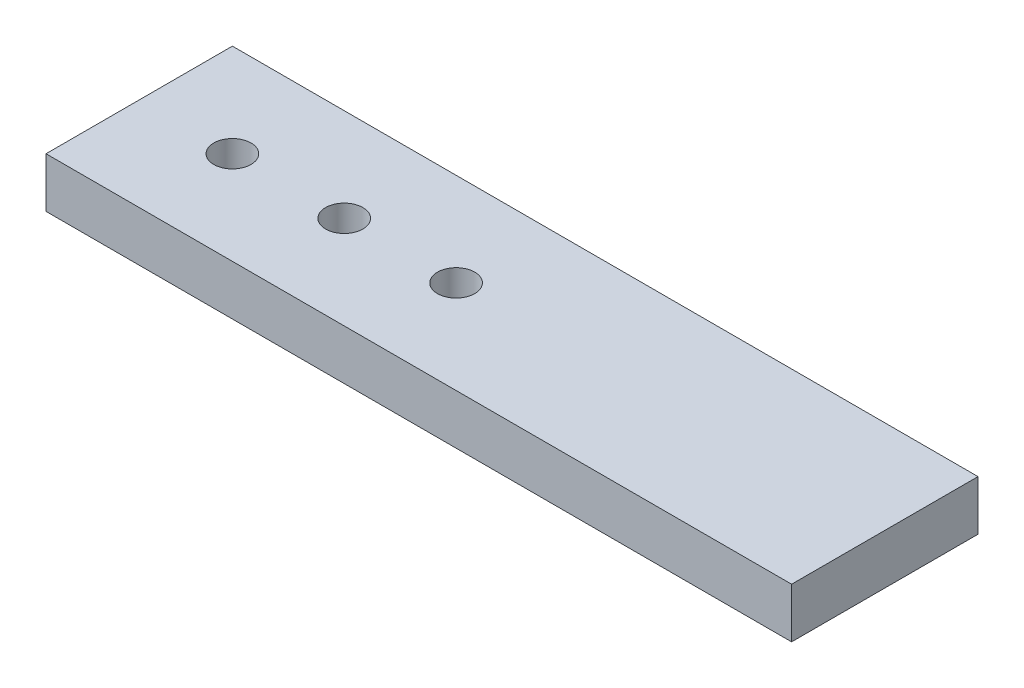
ISO-10303-21;
HEADER;
FILE_DESCRIPTION(('STEP AP214'),'2;1');
FILE_NAME('part.step','',(''),(''),'','','');
FILE_SCHEMA(('AUTOMOTIVE_DESIGN { 1 0 10303 214 1 1 1 1 }'));
ENDSEC;
DATA;
#1=APPLICATION_CONTEXT('core data for automotive mechanical design processes');
#2=APPLICATION_PROTOCOL_DEFINITION('international standard','automotive_design',2000,#1);
#3=PRODUCT_CONTEXT('',#1,'mechanical');
#4=PRODUCT('Part','Part','',(#3));
#5=PRODUCT_RELATED_PRODUCT_CATEGORY('part','',(#4));
#6=PRODUCT_DEFINITION_FORMATION('','',#4);
#7=PRODUCT_DEFINITION_CONTEXT('part definition',#1,'design');
#8=PRODUCT_DEFINITION('design','',#6,#7);
#9=PRODUCT_DEFINITION_SHAPE('','',#8);
#10=(LENGTH_UNIT() NAMED_UNIT(*) SI_UNIT(.MILLI.,.METRE.));
#11=(NAMED_UNIT(*) PLANE_ANGLE_UNIT() SI_UNIT($,.RADIAN.));
#12=(NAMED_UNIT(*) SI_UNIT($,.STERADIAN.) SOLID_ANGLE_UNIT());
#13=UNCERTAINTY_MEASURE_WITH_UNIT(LENGTH_MEASURE(1.E-05),#10,'distance_accuracy_value','');
#14=(GEOMETRIC_REPRESENTATION_CONTEXT(3) GLOBAL_UNCERTAINTY_ASSIGNED_CONTEXT((#13)) GLOBAL_UNIT_ASSIGNED_CONTEXT((#10,
#11,#12)) REPRESENTATION_CONTEXT('',''));
#15=CARTESIAN_POINT('',(0.,0.,0.));
#16=DIRECTION('',(0.,0.,1.));
#17=DIRECTION('',(1.,0.,0.));
#18=AXIS2_PLACEMENT_3D('',#15,#16,#17);
#19=CARTESIAN_POINT('',(0.,13.4,0.));
#20=DIRECTION('',(1.,0.,0.));
#21=DIRECTION('',(0.,0.,-1.));
#22=AXIS2_PLACEMENT_3D('',#19,#20,#21);
#23=PLANE('',#22);
#24=DIRECTION('',(0.,0.,1.));
#25=VECTOR('',#24,1.);
#26=CARTESIAN_POINT('',(0.,0.,0.));
#27=LINE('',#26,#25);
#28=CARTESIAN_POINT('',(0.,0.,-50.));
#29=VERTEX_POINT('',#28);
#30=CARTESIAN_POINT('',(0.,0.,0.));
#31=VERTEX_POINT('',#30);
#32=EDGE_CURVE('E102',#29,#31,#27,.T.);
#33=ORIENTED_EDGE('',*,*,#32,.T.);
#34=DIRECTION('',(0.,-1.,0.));
#35=VECTOR('',#34,1.);
#36=CARTESIAN_POINT('',(0.,13.4,0.));
#37=LINE('',#36,#35);
#38=CARTESIAN_POINT('',(0.,13.4,0.));
#39=VERTEX_POINT('',#38);
#40=EDGE_CURVE('E93',#39,#31,#37,.T.);
#41=ORIENTED_EDGE('',*,*,#40,.F.);
#42=DIRECTION('',(0.,0.,1.));
#43=VECTOR('',#42,1.);
#44=CARTESIAN_POINT('',(0.,13.4,0.));
#45=LINE('',#44,#43);
#46=CARTESIAN_POINT('',(0.,13.4,-50.));
#47=VERTEX_POINT('',#46);
#48=EDGE_CURVE('E87',#47,#39,#45,.T.);
#49=ORIENTED_EDGE('',*,*,#48,.F.);
#50=DIRECTION('',(0.,-1.,0.));
#51=VECTOR('',#50,1.);
#52=CARTESIAN_POINT('',(0.,13.4,-50.));
#53=LINE('',#52,#51);
#54=EDGE_CURVE('E98',#47,#29,#53,.T.);
#55=ORIENTED_EDGE('',*,*,#54,.T.);
#56=EDGE_LOOP('',(#33,#41,#49,#55));
#57=FACE_BOUND('',#56,.T.);
#58=ADVANCED_FACE('F33',(#57),#23,.F.);
#59=CARTESIAN_POINT('',(0.,13.4,0.));
#60=DIRECTION('',(0.,0.,-1.));
#61=DIRECTION('',(-1.,0.,0.));
#62=AXIS2_PLACEMENT_3D('',#59,#60,#61);
#63=PLANE('',#62);
#64=DIRECTION('',(1.,0.,0.));
#65=VECTOR('',#64,1.);
#66=CARTESIAN_POINT('',(0.,0.,0.));
#67=LINE('',#66,#65);
#68=CARTESIAN_POINT('',(199.999999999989,0.,0.));
#69=VERTEX_POINT('',#68);
#70=EDGE_CURVE('E92',#31,#69,#67,.T.);
#71=ORIENTED_EDGE('',*,*,#70,.T.);
#72=DIRECTION('',(0.,-1.,0.));
#73=VECTOR('',#72,1.);
#74=CARTESIAN_POINT('',(199.999999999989,13.4,0.));
#75=LINE('',#74,#73);
#76=CARTESIAN_POINT('',(199.999999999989,13.4,0.));
#77=VERTEX_POINT('',#76);
#78=EDGE_CURVE('E90',#77,#69,#75,.T.);
#79=ORIENTED_EDGE('',*,*,#78,.F.);
#80=DIRECTION('',(1.,0.,0.));
#81=VECTOR('',#80,1.);
#82=CARTESIAN_POINT('',(0.,13.4,0.));
#83=LINE('',#82,#81);
#84=EDGE_CURVE('E81',#39,#77,#83,.T.);
#85=ORIENTED_EDGE('',*,*,#84,.F.);
#86=ORIENTED_EDGE('',*,*,#40,.T.);
#87=EDGE_LOOP('',(#71,#79,#85,#86));
#88=FACE_BOUND('',#87,.T.);
#89=ADVANCED_FACE('F91',(#88),#63,.F.);
#90=CARTESIAN_POINT('',(199.999999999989,13.4,0.));
#91=DIRECTION('',(-1.,0.,0.));
#92=DIRECTION('',(0.,0.,1.));
#93=AXIS2_PLACEMENT_3D('',#90,#91,#92);
#94=PLANE('',#93);
#95=DIRECTION('',(0.,0.,-1.));
#96=VECTOR('',#95,1.);
#97=CARTESIAN_POINT('',(199.999999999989,0.,0.));
#98=LINE('',#97,#96);
#99=CARTESIAN_POINT('',(199.999999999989,0.,-50.));
#100=VERTEX_POINT('',#99);
#101=EDGE_CURVE('E67',#69,#100,#98,.T.);
#102=ORIENTED_EDGE('',*,*,#101,.T.);
#103=DIRECTION('',(0.,-1.,0.));
#104=VECTOR('',#103,1.);
#105=CARTESIAN_POINT('',(199.999999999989,13.4,-50.));
#106=LINE('',#105,#104);
#107=CARTESIAN_POINT('',(199.999999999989,13.4,-50.));
#108=VERTEX_POINT('',#107);
#109=EDGE_CURVE('E94',#108,#100,#106,.T.);
#110=ORIENTED_EDGE('',*,*,#109,.F.);
#111=DIRECTION('',(0.,0.,-1.));
#112=VECTOR('',#111,1.);
#113=CARTESIAN_POINT('',(199.999999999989,13.4,0.));
#114=LINE('',#113,#112);
#115=EDGE_CURVE('E85',#77,#108,#114,.T.);
#116=ORIENTED_EDGE('',*,*,#115,.F.);
#117=ORIENTED_EDGE('',*,*,#78,.T.);
#118=EDGE_LOOP('',(#102,#110,#116,#117));
#119=FACE_BOUND('',#118,.T.);
#120=ADVANCED_FACE('F96',(#119),#94,.F.);
#121=CARTESIAN_POINT('',(0.,13.4,-50.));
#122=DIRECTION('',(0.,0.,1.));
#123=DIRECTION('',(1.,0.,0.));
#124=AXIS2_PLACEMENT_3D('',#121,#122,#123);
#125=PLANE('',#124);
#126=DIRECTION('',(-1.,0.,0.));
#127=VECTOR('',#126,1.);
#128=CARTESIAN_POINT('',(0.,0.,-50.));
#129=LINE('',#128,#127);
#130=EDGE_CURVE('E73',#100,#29,#129,.T.);
#131=ORIENTED_EDGE('',*,*,#130,.T.);
#132=ORIENTED_EDGE('',*,*,#54,.F.);
#133=DIRECTION('',(-1.,0.,0.));
#134=VECTOR('',#133,1.);
#135=CARTESIAN_POINT('',(0.,13.4,-50.));
#136=LINE('',#135,#134);
#137=EDGE_CURVE('E50',#108,#47,#136,.T.);
#138=ORIENTED_EDGE('',*,*,#137,.F.);
#139=ORIENTED_EDGE('',*,*,#109,.T.);
#140=EDGE_LOOP('',(#131,#132,#138,#139));
#141=FACE_BOUND('',#140,.T.);
#142=ADVANCED_FACE('F121',(#141),#125,.F.);
#143=CARTESIAN_POINT('',(0.,13.4,-50.));
#144=DIRECTION('',(0.,-1.,0.));
#145=DIRECTION('',(0.,0.,-1.));
#146=AXIS2_PLACEMENT_3D('',#143,#144,#145);
#147=PLANE('',#146);
#148=CARTESIAN_POINT('',(55.,13.4,-25.));
#149=DIRECTION('',(0.,1.,0.));
#150=DIRECTION('',(0.,0.,1.));
#151=AXIS2_PLACEMENT_3D('',#148,#149,#150);
#152=CIRCLE('',#151,4.99999999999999);
#153=CARTESIAN_POINT('',(55.,13.4,-20.));
#154=VERTEX_POINT('',#153);
#155=EDGE_CURVE('E193',#154,#154,#152,.T.);
#156=ORIENTED_EDGE('',*,*,#155,.F.);
#157=EDGE_LOOP('',(#156));
#158=FACE_BOUND('',#157,.T.);
#159=CARTESIAN_POINT('',(25.,13.4,-25.));
#160=DIRECTION('',(0.,1.,0.));
#161=DIRECTION('',(0.,0.,1.));
#162=AXIS2_PLACEMENT_3D('',#159,#160,#161);
#163=CIRCLE('',#162,4.99999999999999);
#164=CARTESIAN_POINT('',(25.,13.4,-20.));
#165=VERTEX_POINT('',#164);
#166=EDGE_CURVE('E194',#165,#165,#163,.T.);
#167=ORIENTED_EDGE('',*,*,#166,.F.);
#168=EDGE_LOOP('',(#167));
#169=FACE_BOUND('',#168,.T.);
#170=ORIENTED_EDGE('',*,*,#48,.T.);
#171=ORIENTED_EDGE('',*,*,#84,.T.);
#172=ORIENTED_EDGE('',*,*,#115,.T.);
#173=ORIENTED_EDGE('',*,*,#137,.T.);
#174=EDGE_LOOP('',(#170,#171,#172,#173));
#175=FACE_BOUND('',#174,.T.);
#176=CARTESIAN_POINT('',(85.,13.4,-25.));
#177=DIRECTION('',(0.,1.,0.));
#178=DIRECTION('',(0.,0.,1.));
#179=AXIS2_PLACEMENT_3D('',#176,#177,#178);
#180=CIRCLE('',#179,4.99999999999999);
#181=CARTESIAN_POINT('',(85.,13.4,-20.));
#182=VERTEX_POINT('',#181);
#183=EDGE_CURVE('E11',#182,#182,#180,.T.);
#184=ORIENTED_EDGE('',*,*,#183,.F.);
#185=EDGE_LOOP('',(#184));
#186=FACE_BOUND('',#185,.T.);
#187=ADVANCED_FACE('F82',(#158,#169,#175,#186),#147,.F.);
#188=CARTESIAN_POINT('',(0.,0.,-50.));
#189=DIRECTION('',(0.,-1.,0.));
#190=DIRECTION('',(0.,0.,-1.));
#191=AXIS2_PLACEMENT_3D('',#188,#189,#190);
#192=PLANE('',#191);
#193=CARTESIAN_POINT('',(55.,0.,-25.));
#194=DIRECTION('',(0.,1.,0.));
#195=DIRECTION('',(0.,0.,1.));
#196=AXIS2_PLACEMENT_3D('',#193,#194,#195);
#197=CIRCLE('',#196,5.);
#198=CARTESIAN_POINT('',(55.,0.,-20.));
#199=VERTEX_POINT('',#198);
#200=EDGE_CURVE('E191',#199,#199,#197,.T.);
#201=ORIENTED_EDGE('',*,*,#200,.T.);
#202=EDGE_LOOP('',(#201));
#203=FACE_BOUND('',#202,.T.);
#204=CARTESIAN_POINT('',(25.,0.,-25.));
#205=DIRECTION('',(0.,1.,0.));
#206=DIRECTION('',(0.,0.,1.));
#207=AXIS2_PLACEMENT_3D('',#204,#205,#206);
#208=CIRCLE('',#207,5.);
#209=CARTESIAN_POINT('',(25.,0.,-20.));
#210=VERTEX_POINT('',#209);
#211=EDGE_CURVE('E105',#210,#210,#208,.T.);
#212=ORIENTED_EDGE('',*,*,#211,.T.);
#213=EDGE_LOOP('',(#212));
#214=FACE_BOUND('',#213,.T.);
#215=ORIENTED_EDGE('',*,*,#32,.F.);
#216=ORIENTED_EDGE('',*,*,#130,.F.);
#217=ORIENTED_EDGE('',*,*,#101,.F.);
#218=ORIENTED_EDGE('',*,*,#70,.F.);
#219=EDGE_LOOP('',(#215,#216,#217,#218));
#220=FACE_BOUND('',#219,.T.);
#221=CARTESIAN_POINT('',(85.,0.,-25.));
#222=DIRECTION('',(0.,1.,0.));
#223=DIRECTION('',(0.,0.,1.));
#224=AXIS2_PLACEMENT_3D('',#221,#222,#223);
#225=CIRCLE('',#224,5.);
#226=CARTESIAN_POINT('',(85.,0.,-20.));
#227=VERTEX_POINT('',#226);
#228=EDGE_CURVE('E42',#227,#227,#225,.T.);
#229=ORIENTED_EDGE('',*,*,#228,.T.);
#230=EDGE_LOOP('',(#229));
#231=FACE_BOUND('',#230,.T.);
#232=ADVANCED_FACE('F114',(#203,#214,#220,#231),#192,.T.);
#233=CARTESIAN_POINT('',(25.,13.4,-25.));
#234=DIRECTION('',(0.,1.,0.));
#235=DIRECTION('',(0.,0.,1.));
#236=AXIS2_PLACEMENT_3D('',#233,#234,#235);
#237=CYLINDRICAL_SURFACE('',#236,4.99999999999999);
#238=ORIENTED_EDGE('',*,*,#211,.F.);
#239=EDGE_LOOP('',(#238));
#240=FACE_BOUND('',#239,.T.);
#241=ORIENTED_EDGE('',*,*,#166,.T.);
#242=EDGE_LOOP('',(#241));
#243=FACE_BOUND('',#242,.T.);
#244=ADVANCED_FACE('F128',(#240,#243),#237,.F.);
#245=CARTESIAN_POINT('',(55.,13.4,-25.));
#246=DIRECTION('',(0.,1.,0.));
#247=DIRECTION('',(0.,0.,1.));
#248=AXIS2_PLACEMENT_3D('',#245,#246,#247);
#249=CYLINDRICAL_SURFACE('',#248,4.99999999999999);
#250=ORIENTED_EDGE('',*,*,#200,.F.);
#251=EDGE_LOOP('',(#250));
#252=FACE_BOUND('',#251,.T.);
#253=ORIENTED_EDGE('',*,*,#155,.T.);
#254=EDGE_LOOP('',(#253));
#255=FACE_BOUND('',#254,.T.);
#256=ADVANCED_FACE('F118',(#252,#255),#249,.F.);
#257=CARTESIAN_POINT('',(85.,13.4,-25.));
#258=DIRECTION('',(0.,1.,0.));
#259=DIRECTION('',(0.,0.,1.));
#260=AXIS2_PLACEMENT_3D('',#257,#258,#259);
#261=CYLINDRICAL_SURFACE('',#260,4.99999999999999);
#262=ORIENTED_EDGE('',*,*,#228,.F.);
#263=EDGE_LOOP('',(#262));
#264=FACE_BOUND('',#263,.T.);
#265=ORIENTED_EDGE('',*,*,#183,.T.);
#266=EDGE_LOOP('',(#265));
#267=FACE_BOUND('',#266,.T.);
#268=ADVANCED_FACE('F35',(#264,#267),#261,.F.);
#269=CLOSED_SHELL('',(#58,#89,#120,#142,#187,#232,#244,#256,#268));
#270=MANIFOLD_SOLID_BREP('B2',#269);
#271=ADVANCED_BREP_SHAPE_REPRESENTATION('',(#18,#270),#14);
#272=SHAPE_DEFINITION_REPRESENTATION(#9,#271);
ENDSEC;
END-ISO-10303-21;
